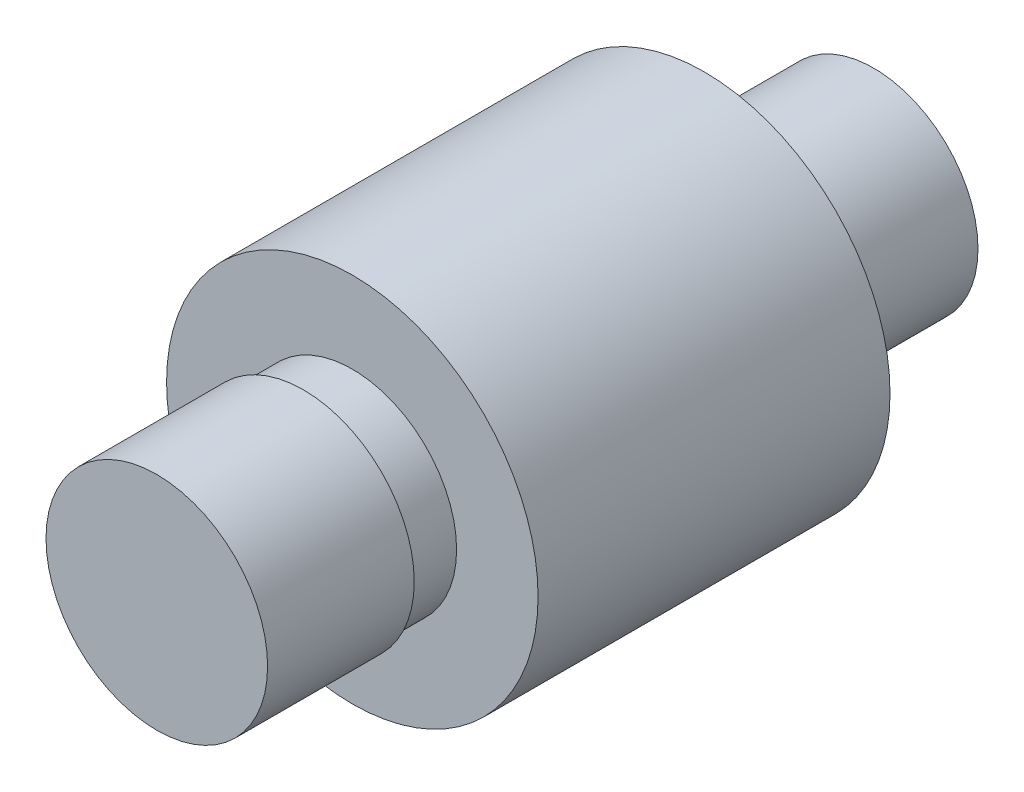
from build123d import *

# Parameters (mm, degrees)
SKETCH1_R           = 85
BOSS_EXTRUDE1_DEPTH = 112.5
SKETCH2_R           = 80
BOSS_EXTRUDE2_DEPTH = 37.5
SKETCH3_R           = 142.5
BOSS_EXTRUDE3_DEPTH = 270
SKETCH4_R           = 80
BOSS_EXTRUDE4_DEPTH = 130


with BuildPart() as part:
    # Sketch1 → Boss-Extrude1 (new body)
    with BuildSketch(Plane.XY):
        Circle(SKETCH1_R)
    extrude(amount=BOSS_EXTRUDE1_DEPTH)

    # Sketch2 → Boss-Extrude2 (add)
    with BuildSketch(Plane(origin=(0, 0, 0), x_dir=(-1, 0, 0), z_dir=(0, 0, -1))):
        Circle(SKETCH2_R)
    extrude(amount=BOSS_EXTRUDE2_DEPTH)

    # Sketch3 → Boss-Extrude3 (add)
    with BuildSketch(Plane(origin=(0, 0, -37.5), x_dir=(-1, 0, 0), z_dir=(0, 0, -1))):
        Circle(SKETCH3_R)
    extrude(amount=BOSS_EXTRUDE3_DEPTH)

    # Sketch4 → Boss-Extrude4 (add)
    with BuildSketch(Plane(origin=(0, 0, -307.5), x_dir=(-1, 0, 0), z_dir=(0, 0, -1))):
        Circle(SKETCH4_R)
    extrude(amount=BOSS_EXTRUDE4_DEPTH)


solid = part.part
